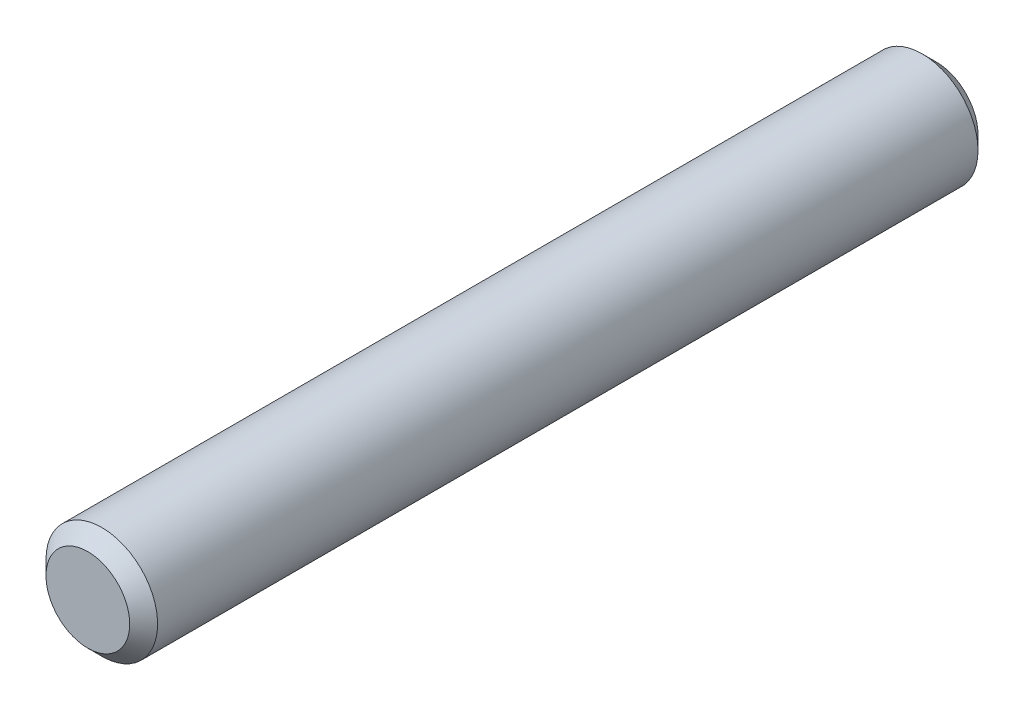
ISO-10303-21;
HEADER;
FILE_DESCRIPTION(('STEP AP214'),'2;1');
FILE_NAME('part.step','',(''),(''),'','','');
FILE_SCHEMA(('AUTOMOTIVE_DESIGN { 1 0 10303 214 1 1 1 1 }'));
ENDSEC;
DATA;
#1=APPLICATION_CONTEXT('core data for automotive mechanical design processes');
#2=APPLICATION_PROTOCOL_DEFINITION('international standard','automotive_design',2000,#1);
#3=PRODUCT_CONTEXT('',#1,'mechanical');
#4=PRODUCT('Part','Part','',(#3));
#5=PRODUCT_RELATED_PRODUCT_CATEGORY('part','',(#4));
#6=PRODUCT_DEFINITION_FORMATION('','',#4);
#7=PRODUCT_DEFINITION_CONTEXT('part definition',#1,'design');
#8=PRODUCT_DEFINITION('design','',#6,#7);
#9=PRODUCT_DEFINITION_SHAPE('','',#8);
#10=(LENGTH_UNIT() NAMED_UNIT(*) SI_UNIT(.MILLI.,.METRE.));
#11=(NAMED_UNIT(*) PLANE_ANGLE_UNIT() SI_UNIT($,.RADIAN.));
#12=(NAMED_UNIT(*) SI_UNIT($,.STERADIAN.) SOLID_ANGLE_UNIT());
#13=UNCERTAINTY_MEASURE_WITH_UNIT(LENGTH_MEASURE(1.E-05),#10,'distance_accuracy_value','');
#14=(GEOMETRIC_REPRESENTATION_CONTEXT(3) GLOBAL_UNCERTAINTY_ASSIGNED_CONTEXT((#13)) GLOBAL_UNIT_ASSIGNED_CONTEXT((#10,
#11,#12)) REPRESENTATION_CONTEXT('',''));
#15=CARTESIAN_POINT('',(0.,0.,0.));
#16=DIRECTION('',(0.,0.,1.));
#17=DIRECTION('',(1.,0.,0.));
#18=AXIS2_PLACEMENT_3D('',#15,#16,#17);
#19=CARTESIAN_POINT('',(-11.3688610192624,14.5380206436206,30.4));
#20=DIRECTION('',(0.,0.,-1.));
#21=DIRECTION('',(-1.,0.,0.));
#22=AXIS2_PLACEMENT_3D('',#19,#20,#21);
#23=CYLINDRICAL_SURFACE('',#22,2.);
#24=CARTESIAN_POINT('',(-11.3688610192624,14.5380206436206,29.9));
#25=DIRECTION('',(0.,0.,1.));
#26=DIRECTION('',(1.,0.,0.));
#27=AXIS2_PLACEMENT_3D('',#24,#25,#26);
#28=CIRCLE('',#27,2.);
#29=CARTESIAN_POINT('',(-13.3688610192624,14.5380206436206,29.9));
#30=VERTEX_POINT('',#29);
#31=EDGE_CURVE('E33',#30,#30,#28,.F.);
#32=CARTESIAN_POINT('',(-11.3688610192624,14.5380206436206,0.500000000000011));
#33=DIRECTION('',(0.,0.,1.));
#34=DIRECTION('',(1.,0.,0.));
#35=AXIS2_PLACEMENT_3D('',#32,#33,#34);
#36=CIRCLE('',#35,2.);
#37=CARTESIAN_POINT('',(-13.3688610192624,14.5380206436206,0.500000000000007));
#38=VERTEX_POINT('',#37);
#39=EDGE_CURVE('E37',#38,#38,#36,.T.);
#40=CARTESIAN_POINT('',(-13.3688610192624,14.5380206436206,29.9));
#41=CARTESIAN_POINT('',(-13.3688610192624,14.5380206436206,29.59375));
#42=CARTESIAN_POINT('',(-13.3688610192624,14.5380206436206,29.2875));
#43=CARTESIAN_POINT('',(-13.3688610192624,14.5380206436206,28.675));
#44=CARTESIAN_POINT('',(-13.3688610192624,14.5380206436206,28.36875));
#45=CARTESIAN_POINT('',(-13.3688610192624,14.5380206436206,27.75625));
#46=CARTESIAN_POINT('',(-13.3688610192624,14.5380206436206,27.45));
#47=CARTESIAN_POINT('',(-13.3688610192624,14.5380206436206,26.8375));
#48=CARTESIAN_POINT('',(-13.3688610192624,14.5380206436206,26.53125));
#49=CARTESIAN_POINT('',(-13.3688610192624,14.5380206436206,25.91875));
#50=CARTESIAN_POINT('',(-13.3688610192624,14.5380206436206,25.6125));
#51=CARTESIAN_POINT('',(-13.3688610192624,14.5380206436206,25.));
#52=CARTESIAN_POINT('',(-13.3688610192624,14.5380206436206,24.69375));
#53=CARTESIAN_POINT('',(-13.3688610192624,14.5380206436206,24.08125));
#54=CARTESIAN_POINT('',(-13.3688610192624,14.5380206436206,23.775));
#55=CARTESIAN_POINT('',(-13.3688610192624,14.5380206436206,23.1625));
#56=CARTESIAN_POINT('',(-13.3688610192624,14.5380206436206,22.85625));
#57=CARTESIAN_POINT('',(-13.3688610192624,14.5380206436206,22.24375));
#58=CARTESIAN_POINT('',(-13.3688610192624,14.5380206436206,21.9375));
#59=CARTESIAN_POINT('',(-13.3688610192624,14.5380206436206,21.325));
#60=CARTESIAN_POINT('',(-13.3688610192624,14.5380206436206,21.01875));
#61=CARTESIAN_POINT('',(-13.3688610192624,14.5380206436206,20.40625));
#62=CARTESIAN_POINT('',(-13.3688610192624,14.5380206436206,20.1));
#63=CARTESIAN_POINT('',(-13.3688610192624,14.5380206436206,19.4875));
#64=CARTESIAN_POINT('',(-13.3688610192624,14.5380206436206,19.18125));
#65=CARTESIAN_POINT('',(-13.3688610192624,14.5380206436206,18.56875));
#66=CARTESIAN_POINT('',(-13.3688610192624,14.5380206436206,18.2625));
#67=CARTESIAN_POINT('',(-13.3688610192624,14.5380206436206,17.65));
#68=CARTESIAN_POINT('',(-13.3688610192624,14.5380206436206,17.34375));
#69=CARTESIAN_POINT('',(-13.3688610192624,14.5380206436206,16.73125));
#70=CARTESIAN_POINT('',(-13.3688610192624,14.5380206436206,16.425));
#71=CARTESIAN_POINT('',(-13.3688610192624,14.5380206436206,15.8125));
#72=CARTESIAN_POINT('',(-13.3688610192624,14.5380206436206,15.50625));
#73=CARTESIAN_POINT('',(-13.3688610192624,14.5380206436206,14.89375));
#74=CARTESIAN_POINT('',(-13.3688610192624,14.5380206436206,14.5875));
#75=CARTESIAN_POINT('',(-13.3688610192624,14.5380206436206,13.975));
#76=CARTESIAN_POINT('',(-13.3688610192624,14.5380206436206,13.66875));
#77=CARTESIAN_POINT('',(-13.3688610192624,14.5380206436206,13.05625));
#78=CARTESIAN_POINT('',(-13.3688610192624,14.5380206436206,12.75));
#79=CARTESIAN_POINT('',(-13.3688610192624,14.5380206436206,12.1375));
#80=CARTESIAN_POINT('',(-13.3688610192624,14.5380206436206,11.83125));
#81=CARTESIAN_POINT('',(-13.3688610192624,14.5380206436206,11.21875));
#82=CARTESIAN_POINT('',(-13.3688610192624,14.5380206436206,10.9125));
#83=CARTESIAN_POINT('',(-13.3688610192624,14.5380206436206,10.3));
#84=CARTESIAN_POINT('',(-13.3688610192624,14.5380206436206,9.99375));
#85=CARTESIAN_POINT('',(-13.3688610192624,14.5380206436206,9.38125));
#86=CARTESIAN_POINT('',(-13.3688610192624,14.5380206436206,9.075));
#87=CARTESIAN_POINT('',(-13.3688610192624,14.5380206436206,8.4625));
#88=CARTESIAN_POINT('',(-13.3688610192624,14.5380206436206,8.15625));
#89=CARTESIAN_POINT('',(-13.3688610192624,14.5380206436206,7.54375));
#90=CARTESIAN_POINT('',(-13.3688610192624,14.5380206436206,7.2375));
#91=CARTESIAN_POINT('',(-13.3688610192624,14.5380206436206,6.625));
#92=CARTESIAN_POINT('',(-13.3688610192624,14.5380206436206,6.31875));
#93=CARTESIAN_POINT('',(-13.3688610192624,14.5380206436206,5.70625));
#94=CARTESIAN_POINT('',(-13.3688610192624,14.5380206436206,5.4));
#95=CARTESIAN_POINT('',(-13.3688610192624,14.5380206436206,4.7875));
#96=CARTESIAN_POINT('',(-13.3688610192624,14.5380206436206,4.48125));
#97=CARTESIAN_POINT('',(-13.3688610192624,14.5380206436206,3.86875));
#98=CARTESIAN_POINT('',(-13.3688610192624,14.5380206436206,3.5625));
#99=CARTESIAN_POINT('',(-13.3688610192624,14.5380206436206,2.95));
#100=CARTESIAN_POINT('',(-13.3688610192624,14.5380206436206,2.64375));
#101=CARTESIAN_POINT('',(-13.3688610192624,14.5380206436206,2.03125000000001));
#102=CARTESIAN_POINT('',(-13.3688610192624,14.5380206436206,1.725));
#103=CARTESIAN_POINT('',(-13.3688610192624,14.5380206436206,1.1125));
#104=CARTESIAN_POINT('',(-13.3688610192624,14.5380206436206,0.806250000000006));
#105=CARTESIAN_POINT('',(-13.3688610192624,14.5380206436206,0.500000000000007));
#106=B_SPLINE_CURVE_WITH_KNOTS('',3,(#40,#41,#42,#43,#44,#45,#46,#47,#48,#49,#50,#51,#52,#53,
#54,#55,#56,#57,#58,#59,#60,#61,#62,#63,#64,#65,#66,#67,#68,#69,#70,#71,#72,#73,#74,#75,#76,#77,
#78,#79,#80,#81,#82,#83,#84,#85,#86,#87,#88,#89,#90,#91,#92,#93,#94,#95,#96,#97,#98,#99,#100,
#101,#102,#103,#104,#105),.UNSPECIFIED.,.F.,.F.,(4,2,2,2,2,2,2,2,2,2,2,2,2,2,2,2,2,2,2,2,2,2,2,
2,2,2,2,2,2,2,2,2,4),(0.,0.918749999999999,1.8375,2.75625,3.675,4.59375,5.5125,6.43125,7.35,
8.26875,9.18749999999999,10.10625,11.025,11.94375,12.8625,13.78125,14.7,15.61875,16.5375,
17.45625,18.375,19.29375,20.2125,21.13125,22.05,22.96875,23.8875,24.80625,25.725,26.64375,
27.5625,28.48125,29.4),.UNSPECIFIED.);
#107=EDGE_CURVE('BSEAM27',#30,#38,#106,.T.);
#108=ORIENTED_EDGE('',*,*,#31,.T.);
#109=ORIENTED_EDGE('',*,*,#39,.T.);
#110=ORIENTED_EDGE('',*,*,#107,.T.);
#111=ORIENTED_EDGE('',*,*,#107,.F.);
#112=EDGE_LOOP('',(#108,#110,#109,#111));
#113=FACE_BOUND('',#112,.T.);
#114=ADVANCED_FACE('F27',(#113),#23,.T.);
#115=CARTESIAN_POINT('',(-11.3688610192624,14.5380206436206,30.4));
#116=DIRECTION('',(0.,0.,1.));
#117=DIRECTION('',(1.,0.,0.));
#118=AXIS2_PLACEMENT_3D('',#115,#116,#117);
#119=PLANE('',#118);
#120=CARTESIAN_POINT('',(-11.3688610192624,14.5380206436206,30.4));
#121=DIRECTION('',(0.,0.,1.));
#122=DIRECTION('',(1.,0.,0.));
#123=AXIS2_PLACEMENT_3D('',#120,#121,#122);
#124=CIRCLE('',#123,1.49999999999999);
#125=CARTESIAN_POINT('',(-9.86886101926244,14.5380206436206,30.4));
#126=VERTEX_POINT('',#125);
#127=EDGE_CURVE('E41',#126,#126,#124,.T.);
#128=ORIENTED_EDGE('',*,*,#127,.T.);
#129=EDGE_LOOP('',(#128));
#130=FACE_BOUND('',#129,.T.);
#131=ADVANCED_FACE('F47',(#130),#119,.T.);
#132=CARTESIAN_POINT('',(-11.3688610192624,14.5380206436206,0.));
#133=DIRECTION('',(0.,0.,1.));
#134=DIRECTION('',(1.,0.,0.));
#135=AXIS2_PLACEMENT_3D('',#132,#133,#134);
#136=PLANE('',#135);
#137=CARTESIAN_POINT('',(-11.3688610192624,14.5380206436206,0.));
#138=DIRECTION('',(0.,0.,1.));
#139=DIRECTION('',(1.,0.,0.));
#140=AXIS2_PLACEMENT_3D('',#137,#138,#139);
#141=CIRCLE('',#140,1.49999999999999);
#142=CARTESIAN_POINT('',(-9.86886101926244,14.5380206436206,0.));
#143=VERTEX_POINT('',#142);
#144=EDGE_CURVE('E10',#143,#143,#141,.F.);
#145=ORIENTED_EDGE('',*,*,#144,.T.);
#146=EDGE_LOOP('',(#145));
#147=FACE_BOUND('',#146,.T.);
#148=ADVANCED_FACE('F52',(#147),#136,.F.);
#149=CARTESIAN_POINT('',(-11.3688610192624,14.5380206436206,30.4));
#150=DIRECTION('',(0.,0.,-1.));
#151=DIRECTION('',(-1.,0.,0.));
#152=AXIS2_PLACEMENT_3D('',#149,#150,#151);
#153=CONICAL_SURFACE('',#152,1.49999999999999,0.785398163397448);
#154=ORIENTED_EDGE('',*,*,#31,.F.);
#155=EDGE_LOOP('',(#154));
#156=FACE_BOUND('',#155,.T.);
#157=ORIENTED_EDGE('',*,*,#127,.F.);
#158=EDGE_LOOP('',(#157));
#159=FACE_BOUND('',#158,.T.);
#160=ADVANCED_FACE('F49',(#156,#159),#153,.T.);
#161=CARTESIAN_POINT('',(-11.3688610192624,14.5380206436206,0.500000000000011));
#162=DIRECTION('',(0.,0.,1.));
#163=DIRECTION('',(1.,0.,0.));
#164=AXIS2_PLACEMENT_3D('',#161,#162,#163);
#165=CONICAL_SURFACE('',#164,2.,0.785398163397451);
#166=ORIENTED_EDGE('',*,*,#144,.F.);
#167=EDGE_LOOP('',(#166));
#168=FACE_BOUND('',#167,.T.);
#169=ORIENTED_EDGE('',*,*,#39,.F.);
#170=EDGE_LOOP('',(#169));
#171=FACE_BOUND('',#170,.T.);
#172=ADVANCED_FACE('F51',(#168,#171),#165,.T.);
#173=CLOSED_SHELL('',(#114,#131,#148,#160,#172));
#174=MANIFOLD_SOLID_BREP('B2',#173);
#175=ADVANCED_BREP_SHAPE_REPRESENTATION('',(#18,#174),#14);
#176=SHAPE_DEFINITION_REPRESENTATION(#9,#175);
ENDSEC;
END-ISO-10303-21;
